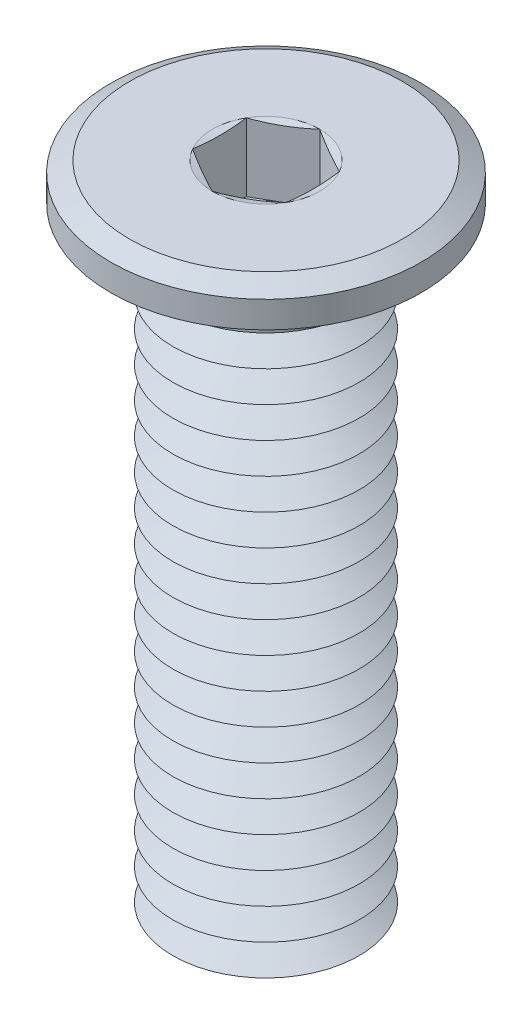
ISO-10303-21;
HEADER;
FILE_DESCRIPTION(('STEP AP214'),'2;1');
FILE_NAME('part.step','',(''),(''),'','','');
FILE_SCHEMA(('AUTOMOTIVE_DESIGN { 1 0 10303 214 1 1 1 1 }'));
ENDSEC;
DATA;
#1=APPLICATION_CONTEXT('core data for automotive mechanical design processes');
#2=APPLICATION_PROTOCOL_DEFINITION('international standard','automotive_design',2000,#1);
#3=PRODUCT_CONTEXT('',#1,'mechanical');
#4=PRODUCT('Part','Part','',(#3));
#5=PRODUCT_RELATED_PRODUCT_CATEGORY('part','',(#4));
#6=PRODUCT_DEFINITION_FORMATION('','',#4);
#7=PRODUCT_DEFINITION_CONTEXT('part definition',#1,'design');
#8=PRODUCT_DEFINITION('design','',#6,#7);
#9=PRODUCT_DEFINITION_SHAPE('','',#8);
#10=(LENGTH_UNIT() NAMED_UNIT(*) SI_UNIT(.MILLI.,.METRE.));
#11=(NAMED_UNIT(*) PLANE_ANGLE_UNIT() SI_UNIT($,.RADIAN.));
#12=(NAMED_UNIT(*) SI_UNIT($,.STERADIAN.) SOLID_ANGLE_UNIT());
#13=UNCERTAINTY_MEASURE_WITH_UNIT(LENGTH_MEASURE(1.E-05),#10,'distance_accuracy_value','');
#14=(GEOMETRIC_REPRESENTATION_CONTEXT(3) GLOBAL_UNCERTAINTY_ASSIGNED_CONTEXT((#13)) GLOBAL_UNIT_ASSIGNED_CONTEXT((#10,
#11,#12)) REPRESENTATION_CONTEXT('',''));
#15=CARTESIAN_POINT('',(0.,0.,0.));
#16=DIRECTION('',(0.,0.,1.));
#17=DIRECTION('',(1.,0.,0.));
#18=AXIS2_PLACEMENT_3D('',#15,#16,#17);
#19=CARTESIAN_POINT('',(0.,-19.7,0.));
#20=DIRECTION('',(0.,-1.,0.));
#21=DIRECTION('',(0.,0.,-1.));
#22=AXIS2_PLACEMENT_3D('',#19,#20,#21);
#23=CONICAL_SURFACE('',#22,3.,1.0471975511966);
#24=CARTESIAN_POINT('',(0.,-19.2,0.));
#25=DIRECTION('',(0.,1.,0.));
#26=DIRECTION('',(0.,0.,1.));
#27=AXIS2_PLACEMENT_3D('',#24,#25,#26);
#28=CIRCLE('',#27,2.13397459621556);
#29=CARTESIAN_POINT('',(0.,-19.2,2.13397459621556));
#30=VERTEX_POINT('',#29);
#31=EDGE_CURVE('E505',#30,#30,#28,.T.);
#32=ORIENTED_EDGE('',*,*,#31,.F.);
#33=EDGE_LOOP('',(#32));
#34=FACE_BOUND('',#33,.T.);
#35=CARTESIAN_POINT('',(0.,-19.7,0.));
#36=DIRECTION('',(0.,1.,0.));
#37=DIRECTION('',(0.,0.,1.));
#38=AXIS2_PLACEMENT_3D('',#35,#36,#37);
#39=CIRCLE('',#38,3.);
#40=CARTESIAN_POINT('',(0.,-19.7,3.));
#41=VERTEX_POINT('',#40);
#42=EDGE_CURVE('E509',#41,#41,#39,.T.);
#43=ORIENTED_EDGE('',*,*,#42,.T.);
#44=EDGE_LOOP('',(#43));
#45=FACE_BOUND('',#44,.T.);
#46=ADVANCED_FACE('F39',(#34,#45),#23,.T.);
#47=CARTESIAN_POINT('',(0.,-19.2,0.));
#48=DIRECTION('',(0.,1.,0.));
#49=DIRECTION('',(0.,0.,1.));
#50=AXIS2_PLACEMENT_3D('',#47,#48,#49);
#51=CONICAL_SURFACE('',#50,2.13397459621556,1.0471975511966);
#52=CARTESIAN_POINT('',(0.,-18.7,0.));
#53=DIRECTION('',(0.,1.,0.));
#54=DIRECTION('',(0.,0.,1.));
#55=AXIS2_PLACEMENT_3D('',#52,#53,#54);
#56=CIRCLE('',#55,3.);
#57=CARTESIAN_POINT('',(0.,-18.7,3.));
#58=VERTEX_POINT('',#57);
#59=EDGE_CURVE('E501',#58,#58,#56,.T.);
#60=ORIENTED_EDGE('',*,*,#59,.F.);
#61=EDGE_LOOP('',(#60));
#62=FACE_BOUND('',#61,.T.);
#63=ORIENTED_EDGE('',*,*,#31,.T.);
#64=EDGE_LOOP('',(#63));
#65=FACE_BOUND('',#64,.T.);
#66=ADVANCED_FACE('F233',(#62,#65),#51,.T.);
#67=CARTESIAN_POINT('',(0.,-21.2,0.));
#68=DIRECTION('',(0.,-1.,0.));
#69=DIRECTION('',(0.,0.,-1.));
#70=AXIS2_PLACEMENT_3D('',#67,#68,#69);
#71=PLANE('',#70);
#72=CARTESIAN_POINT('',(0.,-21.2,0.));
#73=DIRECTION('',(0.,1.,0.));
#74=DIRECTION('',(0.,0.,1.));
#75=AXIS2_PLACEMENT_3D('',#72,#73,#74);
#76=CIRCLE('',#75,2.13397459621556);
#77=CARTESIAN_POINT('',(0.,-21.2,2.13397459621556));
#78=VERTEX_POINT('',#77);
#79=EDGE_CURVE('E300',#78,#78,#76,.T.);
#80=ORIENTED_EDGE('',*,*,#79,.F.);
#81=EDGE_LOOP('',(#80));
#82=FACE_BOUND('',#81,.T.);
#83=ADVANCED_FACE('F239',(#82),#71,.T.);
#84=CARTESIAN_POINT('',(0.,-21.2,0.));
#85=DIRECTION('',(0.,1.,0.));
#86=DIRECTION('',(0.,0.,1.));
#87=AXIS2_PLACEMENT_3D('',#84,#85,#86);
#88=CONICAL_SURFACE('',#87,2.13397459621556,1.0471975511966);
#89=CARTESIAN_POINT('',(0.,-20.7,0.));
#90=DIRECTION('',(0.,1.,0.));
#91=DIRECTION('',(0.,0.,1.));
#92=AXIS2_PLACEMENT_3D('',#89,#90,#91);
#93=CIRCLE('',#92,3.);
#94=CARTESIAN_POINT('',(0.,-20.7,3.));
#95=VERTEX_POINT('',#94);
#96=EDGE_CURVE('E517',#95,#95,#93,.T.);
#97=ORIENTED_EDGE('',*,*,#96,.F.);
#98=EDGE_LOOP('',(#97));
#99=FACE_BOUND('',#98,.T.);
#100=ORIENTED_EDGE('',*,*,#79,.T.);
#101=EDGE_LOOP('',(#100));
#102=FACE_BOUND('',#101,.T.);
#103=ADVANCED_FACE('F254',(#99,#102),#88,.T.);
#104=CARTESIAN_POINT('',(0.,-20.7,0.));
#105=DIRECTION('',(0.,-1.,0.));
#106=DIRECTION('',(0.,0.,-1.));
#107=AXIS2_PLACEMENT_3D('',#104,#105,#106);
#108=CONICAL_SURFACE('',#107,3.,1.0471975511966);
#109=CARTESIAN_POINT('',(0.,-20.2,0.));
#110=DIRECTION('',(0.,1.,0.));
#111=DIRECTION('',(0.,0.,1.));
#112=AXIS2_PLACEMENT_3D('',#109,#110,#111);
#113=CIRCLE('',#112,2.13397459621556);
#114=CARTESIAN_POINT('',(0.,-20.2,2.13397459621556));
#115=VERTEX_POINT('',#114);
#116=EDGE_CURVE('E513',#115,#115,#113,.T.);
#117=ORIENTED_EDGE('',*,*,#116,.F.);
#118=EDGE_LOOP('',(#117));
#119=FACE_BOUND('',#118,.T.);
#120=ORIENTED_EDGE('',*,*,#96,.T.);
#121=EDGE_LOOP('',(#120));
#122=FACE_BOUND('',#121,.T.);
#123=ADVANCED_FACE('F250',(#119,#122),#108,.T.);
#124=CARTESIAN_POINT('',(0.,-20.2,0.));
#125=DIRECTION('',(0.,1.,0.));
#126=DIRECTION('',(0.,0.,1.));
#127=AXIS2_PLACEMENT_3D('',#124,#125,#126);
#128=CONICAL_SURFACE('',#127,2.13397459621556,1.0471975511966);
#129=ORIENTED_EDGE('',*,*,#42,.F.);
#130=EDGE_LOOP('',(#129));
#131=FACE_BOUND('',#130,.T.);
#132=ORIENTED_EDGE('',*,*,#116,.T.);
#133=EDGE_LOOP('',(#132));
#134=FACE_BOUND('',#133,.T.);
#135=ADVANCED_FACE('F246',(#131,#134),#128,.T.);
#136=CARTESIAN_POINT('',(0.,-18.7,0.));
#137=DIRECTION('',(0.,-1.,0.));
#138=DIRECTION('',(0.,0.,-1.));
#139=AXIS2_PLACEMENT_3D('',#136,#137,#138);
#140=CONICAL_SURFACE('',#139,3.,1.0471975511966);
#141=CARTESIAN_POINT('',(0.,-18.2,0.));
#142=DIRECTION('',(0.,1.,0.));
#143=DIRECTION('',(0.,0.,1.));
#144=AXIS2_PLACEMENT_3D('',#141,#142,#143);
#145=CIRCLE('',#144,2.13397459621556);
#146=CARTESIAN_POINT('',(0.,-18.2,2.13397459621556));
#147=VERTEX_POINT('',#146);
#148=EDGE_CURVE('E497',#147,#147,#145,.T.);
#149=ORIENTED_EDGE('',*,*,#148,.F.);
#150=EDGE_LOOP('',(#149));
#151=FACE_BOUND('',#150,.T.);
#152=ORIENTED_EDGE('',*,*,#59,.T.);
#153=EDGE_LOOP('',(#152));
#154=FACE_BOUND('',#153,.T.);
#155=ADVANCED_FACE('F249',(#151,#154),#140,.T.);
#156=CARTESIAN_POINT('',(0.,-18.2,0.));
#157=DIRECTION('',(0.,1.,0.));
#158=DIRECTION('',(0.,0.,1.));
#159=AXIS2_PLACEMENT_3D('',#156,#157,#158);
#160=CONICAL_SURFACE('',#159,2.13397459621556,1.0471975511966);
#161=CARTESIAN_POINT('',(0.,-17.7,0.));
#162=DIRECTION('',(0.,1.,0.));
#163=DIRECTION('',(0.,0.,1.));
#164=AXIS2_PLACEMENT_3D('',#161,#162,#163);
#165=CIRCLE('',#164,3.);
#166=CARTESIAN_POINT('',(0.,-17.7,3.));
#167=VERTEX_POINT('',#166);
#168=EDGE_CURVE('E493',#167,#167,#165,.T.);
#169=ORIENTED_EDGE('',*,*,#168,.F.);
#170=EDGE_LOOP('',(#169));
#171=FACE_BOUND('',#170,.T.);
#172=ORIENTED_EDGE('',*,*,#148,.T.);
#173=EDGE_LOOP('',(#172));
#174=FACE_BOUND('',#173,.T.);
#175=ADVANCED_FACE('F698',(#171,#174),#160,.T.);
#176=CARTESIAN_POINT('',(0.,-17.7,0.));
#177=DIRECTION('',(0.,-1.,0.));
#178=DIRECTION('',(0.,0.,-1.));
#179=AXIS2_PLACEMENT_3D('',#176,#177,#178);
#180=CONICAL_SURFACE('',#179,3.,1.0471975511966);
#181=CARTESIAN_POINT('',(0.,-17.2,0.));
#182=DIRECTION('',(0.,1.,0.));
#183=DIRECTION('',(0.,0.,1.));
#184=AXIS2_PLACEMENT_3D('',#181,#182,#183);
#185=CIRCLE('',#184,2.13397459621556);
#186=CARTESIAN_POINT('',(0.,-17.2,2.13397459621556));
#187=VERTEX_POINT('',#186);
#188=EDGE_CURVE('E489',#187,#187,#185,.T.);
#189=ORIENTED_EDGE('',*,*,#188,.F.);
#190=EDGE_LOOP('',(#189));
#191=FACE_BOUND('',#190,.T.);
#192=ORIENTED_EDGE('',*,*,#168,.T.);
#193=EDGE_LOOP('',(#192));
#194=FACE_BOUND('',#193,.T.);
#195=ADVANCED_FACE('F694',(#191,#194),#180,.T.);
#196=CARTESIAN_POINT('',(0.,-17.2,0.));
#197=DIRECTION('',(0.,1.,0.));
#198=DIRECTION('',(0.,0.,1.));
#199=AXIS2_PLACEMENT_3D('',#196,#197,#198);
#200=CONICAL_SURFACE('',#199,2.13397459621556,1.0471975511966);
#201=CARTESIAN_POINT('',(0.,-16.7,0.));
#202=DIRECTION('',(0.,1.,0.));
#203=DIRECTION('',(0.,0.,1.));
#204=AXIS2_PLACEMENT_3D('',#201,#202,#203);
#205=CIRCLE('',#204,3.);
#206=CARTESIAN_POINT('',(0.,-16.7,3.));
#207=VERTEX_POINT('',#206);
#208=EDGE_CURVE('E485',#207,#207,#205,.T.);
#209=ORIENTED_EDGE('',*,*,#208,.F.);
#210=EDGE_LOOP('',(#209));
#211=FACE_BOUND('',#210,.T.);
#212=ORIENTED_EDGE('',*,*,#188,.T.);
#213=EDGE_LOOP('',(#212));
#214=FACE_BOUND('',#213,.T.);
#215=ADVANCED_FACE('F690',(#211,#214),#200,.T.);
#216=CARTESIAN_POINT('',(0.,-16.7,0.));
#217=DIRECTION('',(0.,-1.,0.));
#218=DIRECTION('',(0.,0.,-1.));
#219=AXIS2_PLACEMENT_3D('',#216,#217,#218);
#220=CONICAL_SURFACE('',#219,3.,1.0471975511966);
#221=CARTESIAN_POINT('',(0.,-16.2,0.));
#222=DIRECTION('',(0.,1.,0.));
#223=DIRECTION('',(0.,0.,1.));
#224=AXIS2_PLACEMENT_3D('',#221,#222,#223);
#225=CIRCLE('',#224,2.13397459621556);
#226=CARTESIAN_POINT('',(0.,-16.2,2.13397459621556));
#227=VERTEX_POINT('',#226);
#228=EDGE_CURVE('E481',#227,#227,#225,.T.);
#229=ORIENTED_EDGE('',*,*,#228,.F.);
#230=EDGE_LOOP('',(#229));
#231=FACE_BOUND('',#230,.T.);
#232=ORIENTED_EDGE('',*,*,#208,.T.);
#233=EDGE_LOOP('',(#232));
#234=FACE_BOUND('',#233,.T.);
#235=ADVANCED_FACE('F686',(#231,#234),#220,.T.);
#236=CARTESIAN_POINT('',(0.,-16.2,0.));
#237=DIRECTION('',(0.,1.,0.));
#238=DIRECTION('',(0.,0.,1.));
#239=AXIS2_PLACEMENT_3D('',#236,#237,#238);
#240=CONICAL_SURFACE('',#239,2.13397459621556,1.0471975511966);
#241=CARTESIAN_POINT('',(0.,-15.7,0.));
#242=DIRECTION('',(0.,1.,0.));
#243=DIRECTION('',(0.,0.,1.));
#244=AXIS2_PLACEMENT_3D('',#241,#242,#243);
#245=CIRCLE('',#244,3.);
#246=CARTESIAN_POINT('',(0.,-15.7,3.));
#247=VERTEX_POINT('',#246);
#248=EDGE_CURVE('E477',#247,#247,#245,.T.);
#249=ORIENTED_EDGE('',*,*,#248,.F.);
#250=EDGE_LOOP('',(#249));
#251=FACE_BOUND('',#250,.T.);
#252=ORIENTED_EDGE('',*,*,#228,.T.);
#253=EDGE_LOOP('',(#252));
#254=FACE_BOUND('',#253,.T.);
#255=ADVANCED_FACE('F682',(#251,#254),#240,.T.);
#256=CARTESIAN_POINT('',(0.,-15.7,0.));
#257=DIRECTION('',(0.,-1.,0.));
#258=DIRECTION('',(0.,0.,-1.));
#259=AXIS2_PLACEMENT_3D('',#256,#257,#258);
#260=CONICAL_SURFACE('',#259,3.,1.0471975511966);
#261=CARTESIAN_POINT('',(0.,-15.2,0.));
#262=DIRECTION('',(0.,1.,0.));
#263=DIRECTION('',(0.,0.,1.));
#264=AXIS2_PLACEMENT_3D('',#261,#262,#263);
#265=CIRCLE('',#264,2.13397459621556);
#266=CARTESIAN_POINT('',(0.,-15.2,2.13397459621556));
#267=VERTEX_POINT('',#266);
#268=EDGE_CURVE('E473',#267,#267,#265,.T.);
#269=ORIENTED_EDGE('',*,*,#268,.F.);
#270=EDGE_LOOP('',(#269));
#271=FACE_BOUND('',#270,.T.);
#272=ORIENTED_EDGE('',*,*,#248,.T.);
#273=EDGE_LOOP('',(#272));
#274=FACE_BOUND('',#273,.T.);
#275=ADVANCED_FACE('F678',(#271,#274),#260,.T.);
#276=CARTESIAN_POINT('',(0.,-15.2,0.));
#277=DIRECTION('',(0.,1.,0.));
#278=DIRECTION('',(0.,0.,1.));
#279=AXIS2_PLACEMENT_3D('',#276,#277,#278);
#280=CONICAL_SURFACE('',#279,2.13397459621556,1.0471975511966);
#281=CARTESIAN_POINT('',(0.,-14.7,0.));
#282=DIRECTION('',(0.,1.,0.));
#283=DIRECTION('',(0.,0.,1.));
#284=AXIS2_PLACEMENT_3D('',#281,#282,#283);
#285=CIRCLE('',#284,3.);
#286=CARTESIAN_POINT('',(0.,-14.7,3.));
#287=VERTEX_POINT('',#286);
#288=EDGE_CURVE('E469',#287,#287,#285,.T.);
#289=ORIENTED_EDGE('',*,*,#288,.F.);
#290=EDGE_LOOP('',(#289));
#291=FACE_BOUND('',#290,.T.);
#292=ORIENTED_EDGE('',*,*,#268,.T.);
#293=EDGE_LOOP('',(#292));
#294=FACE_BOUND('',#293,.T.);
#295=ADVANCED_FACE('F674',(#291,#294),#280,.T.);
#296=CARTESIAN_POINT('',(0.,-14.7,0.));
#297=DIRECTION('',(0.,-1.,0.));
#298=DIRECTION('',(0.,0.,-1.));
#299=AXIS2_PLACEMENT_3D('',#296,#297,#298);
#300=CONICAL_SURFACE('',#299,3.,1.0471975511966);
#301=CARTESIAN_POINT('',(0.,-14.2,0.));
#302=DIRECTION('',(0.,1.,0.));
#303=DIRECTION('',(0.,0.,1.));
#304=AXIS2_PLACEMENT_3D('',#301,#302,#303);
#305=CIRCLE('',#304,2.13397459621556);
#306=CARTESIAN_POINT('',(0.,-14.2,2.13397459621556));
#307=VERTEX_POINT('',#306);
#308=EDGE_CURVE('E466',#307,#307,#305,.T.);
#309=ORIENTED_EDGE('',*,*,#308,.F.);
#310=EDGE_LOOP('',(#309));
#311=FACE_BOUND('',#310,.T.);
#312=ORIENTED_EDGE('',*,*,#288,.T.);
#313=EDGE_LOOP('',(#312));
#314=FACE_BOUND('',#313,.T.);
#315=ADVANCED_FACE('F670',(#311,#314),#300,.T.);
#316=CARTESIAN_POINT('',(0.,-14.2,0.));
#317=DIRECTION('',(0.,1.,0.));
#318=DIRECTION('',(0.,0.,1.));
#319=AXIS2_PLACEMENT_3D('',#316,#317,#318);
#320=CONICAL_SURFACE('',#319,2.13397459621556,1.0471975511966);
#321=CARTESIAN_POINT('',(0.,-13.7,0.));
#322=DIRECTION('',(0.,1.,0.));
#323=DIRECTION('',(0.,0.,1.));
#324=AXIS2_PLACEMENT_3D('',#321,#322,#323);
#325=CIRCLE('',#324,3.);
#326=CARTESIAN_POINT('',(0.,-13.7,3.));
#327=VERTEX_POINT('',#326);
#328=EDGE_CURVE('E462',#327,#327,#325,.T.);
#329=ORIENTED_EDGE('',*,*,#328,.F.);
#330=EDGE_LOOP('',(#329));
#331=FACE_BOUND('',#330,.T.);
#332=ORIENTED_EDGE('',*,*,#308,.T.);
#333=EDGE_LOOP('',(#332));
#334=FACE_BOUND('',#333,.T.);
#335=ADVANCED_FACE('F666',(#331,#334),#320,.T.);
#336=CARTESIAN_POINT('',(0.,-13.7,0.));
#337=DIRECTION('',(0.,-1.,0.));
#338=DIRECTION('',(0.,0.,-1.));
#339=AXIS2_PLACEMENT_3D('',#336,#337,#338);
#340=CONICAL_SURFACE('',#339,3.,1.0471975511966);
#341=CARTESIAN_POINT('',(0.,-13.2,0.));
#342=DIRECTION('',(0.,1.,0.));
#343=DIRECTION('',(0.,0.,1.));
#344=AXIS2_PLACEMENT_3D('',#341,#342,#343);
#345=CIRCLE('',#344,2.13397459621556);
#346=CARTESIAN_POINT('',(0.,-13.2,2.13397459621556));
#347=VERTEX_POINT('',#346);
#348=EDGE_CURVE('E458',#347,#347,#345,.T.);
#349=ORIENTED_EDGE('',*,*,#348,.F.);
#350=EDGE_LOOP('',(#349));
#351=FACE_BOUND('',#350,.T.);
#352=ORIENTED_EDGE('',*,*,#328,.T.);
#353=EDGE_LOOP('',(#352));
#354=FACE_BOUND('',#353,.T.);
#355=ADVANCED_FACE('F662',(#351,#354),#340,.T.);
#356=CARTESIAN_POINT('',(0.,-13.2,0.));
#357=DIRECTION('',(0.,1.,0.));
#358=DIRECTION('',(0.,0.,1.));
#359=AXIS2_PLACEMENT_3D('',#356,#357,#358);
#360=CONICAL_SURFACE('',#359,2.13397459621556,1.0471975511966);
#361=CARTESIAN_POINT('',(0.,-12.7,0.));
#362=DIRECTION('',(0.,1.,0.));
#363=DIRECTION('',(0.,0.,1.));
#364=AXIS2_PLACEMENT_3D('',#361,#362,#363);
#365=CIRCLE('',#364,3.);
#366=CARTESIAN_POINT('',(0.,-12.7,3.));
#367=VERTEX_POINT('',#366);
#368=EDGE_CURVE('E454',#367,#367,#365,.T.);
#369=ORIENTED_EDGE('',*,*,#368,.F.);
#370=EDGE_LOOP('',(#369));
#371=FACE_BOUND('',#370,.T.);
#372=ORIENTED_EDGE('',*,*,#348,.T.);
#373=EDGE_LOOP('',(#372));
#374=FACE_BOUND('',#373,.T.);
#375=ADVANCED_FACE('F658',(#371,#374),#360,.T.);
#376=CARTESIAN_POINT('',(0.,-12.7,0.));
#377=DIRECTION('',(0.,-1.,0.));
#378=DIRECTION('',(0.,0.,-1.));
#379=AXIS2_PLACEMENT_3D('',#376,#377,#378);
#380=CONICAL_SURFACE('',#379,3.,1.0471975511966);
#381=CARTESIAN_POINT('',(0.,-12.2,0.));
#382=DIRECTION('',(0.,1.,0.));
#383=DIRECTION('',(0.,0.,1.));
#384=AXIS2_PLACEMENT_3D('',#381,#382,#383);
#385=CIRCLE('',#384,2.13397459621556);
#386=CARTESIAN_POINT('',(0.,-12.2,2.13397459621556));
#387=VERTEX_POINT('',#386);
#388=EDGE_CURVE('E450',#387,#387,#385,.T.);
#389=ORIENTED_EDGE('',*,*,#388,.F.);
#390=EDGE_LOOP('',(#389));
#391=FACE_BOUND('',#390,.T.);
#392=ORIENTED_EDGE('',*,*,#368,.T.);
#393=EDGE_LOOP('',(#392));
#394=FACE_BOUND('',#393,.T.);
#395=ADVANCED_FACE('F654',(#391,#394),#380,.T.);
#396=CARTESIAN_POINT('',(0.,-12.2,0.));
#397=DIRECTION('',(0.,1.,0.));
#398=DIRECTION('',(0.,0.,1.));
#399=AXIS2_PLACEMENT_3D('',#396,#397,#398);
#400=CONICAL_SURFACE('',#399,2.13397459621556,1.0471975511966);
#401=CARTESIAN_POINT('',(0.,-11.7,0.));
#402=DIRECTION('',(0.,1.,0.));
#403=DIRECTION('',(0.,0.,1.));
#404=AXIS2_PLACEMENT_3D('',#401,#402,#403);
#405=CIRCLE('',#404,3.);
#406=CARTESIAN_POINT('',(0.,-11.7,3.));
#407=VERTEX_POINT('',#406);
#408=EDGE_CURVE('E446',#407,#407,#405,.T.);
#409=ORIENTED_EDGE('',*,*,#408,.F.);
#410=EDGE_LOOP('',(#409));
#411=FACE_BOUND('',#410,.T.);
#412=ORIENTED_EDGE('',*,*,#388,.T.);
#413=EDGE_LOOP('',(#412));
#414=FACE_BOUND('',#413,.T.);
#415=ADVANCED_FACE('F650',(#411,#414),#400,.T.);
#416=CARTESIAN_POINT('',(0.,-11.7,0.));
#417=DIRECTION('',(0.,-1.,0.));
#418=DIRECTION('',(0.,0.,-1.));
#419=AXIS2_PLACEMENT_3D('',#416,#417,#418);
#420=CONICAL_SURFACE('',#419,3.,1.0471975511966);
#421=CARTESIAN_POINT('',(0.,-11.2,0.));
#422=DIRECTION('',(0.,1.,0.));
#423=DIRECTION('',(0.,0.,1.));
#424=AXIS2_PLACEMENT_3D('',#421,#422,#423);
#425=CIRCLE('',#424,2.13397459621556);
#426=CARTESIAN_POINT('',(0.,-11.2,2.13397459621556));
#427=VERTEX_POINT('',#426);
#428=EDGE_CURVE('E442',#427,#427,#425,.T.);
#429=ORIENTED_EDGE('',*,*,#428,.F.);
#430=EDGE_LOOP('',(#429));
#431=FACE_BOUND('',#430,.T.);
#432=ORIENTED_EDGE('',*,*,#408,.T.);
#433=EDGE_LOOP('',(#432));
#434=FACE_BOUND('',#433,.T.);
#435=ADVANCED_FACE('F646',(#431,#434),#420,.T.);
#436=CARTESIAN_POINT('',(0.,-11.2,0.));
#437=DIRECTION('',(0.,1.,0.));
#438=DIRECTION('',(0.,0.,1.));
#439=AXIS2_PLACEMENT_3D('',#436,#437,#438);
#440=CONICAL_SURFACE('',#439,2.13397459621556,1.0471975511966);
#441=CARTESIAN_POINT('',(0.,-10.7,0.));
#442=DIRECTION('',(0.,1.,0.));
#443=DIRECTION('',(0.,0.,1.));
#444=AXIS2_PLACEMENT_3D('',#441,#442,#443);
#445=CIRCLE('',#444,3.);
#446=CARTESIAN_POINT('',(0.,-10.7,3.));
#447=VERTEX_POINT('',#446);
#448=EDGE_CURVE('E438',#447,#447,#445,.T.);
#449=ORIENTED_EDGE('',*,*,#448,.F.);
#450=EDGE_LOOP('',(#449));
#451=FACE_BOUND('',#450,.T.);
#452=ORIENTED_EDGE('',*,*,#428,.T.);
#453=EDGE_LOOP('',(#452));
#454=FACE_BOUND('',#453,.T.);
#455=ADVANCED_FACE('F642',(#451,#454),#440,.T.);
#456=CARTESIAN_POINT('',(0.,-10.7,0.));
#457=DIRECTION('',(0.,-1.,0.));
#458=DIRECTION('',(0.,0.,-1.));
#459=AXIS2_PLACEMENT_3D('',#456,#457,#458);
#460=CONICAL_SURFACE('',#459,3.,1.0471975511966);
#461=CARTESIAN_POINT('',(0.,-10.2,0.));
#462=DIRECTION('',(0.,1.,0.));
#463=DIRECTION('',(0.,0.,1.));
#464=AXIS2_PLACEMENT_3D('',#461,#462,#463);
#465=CIRCLE('',#464,2.13397459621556);
#466=CARTESIAN_POINT('',(0.,-10.2,2.13397459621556));
#467=VERTEX_POINT('',#466);
#468=EDGE_CURVE('E434',#467,#467,#465,.T.);
#469=ORIENTED_EDGE('',*,*,#468,.F.);
#470=EDGE_LOOP('',(#469));
#471=FACE_BOUND('',#470,.T.);
#472=ORIENTED_EDGE('',*,*,#448,.T.);
#473=EDGE_LOOP('',(#472));
#474=FACE_BOUND('',#473,.T.);
#475=ADVANCED_FACE('F638',(#471,#474),#460,.T.);
#476=CARTESIAN_POINT('',(0.,-10.2,0.));
#477=DIRECTION('',(0.,1.,0.));
#478=DIRECTION('',(0.,0.,1.));
#479=AXIS2_PLACEMENT_3D('',#476,#477,#478);
#480=CONICAL_SURFACE('',#479,2.13397459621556,1.0471975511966);
#481=CARTESIAN_POINT('',(0.,-9.7,0.));
#482=DIRECTION('',(0.,1.,0.));
#483=DIRECTION('',(0.,0.,1.));
#484=AXIS2_PLACEMENT_3D('',#481,#482,#483);
#485=CIRCLE('',#484,3.);
#486=CARTESIAN_POINT('',(0.,-9.7,3.));
#487=VERTEX_POINT('',#486);
#488=EDGE_CURVE('E430',#487,#487,#485,.T.);
#489=ORIENTED_EDGE('',*,*,#488,.F.);
#490=EDGE_LOOP('',(#489));
#491=FACE_BOUND('',#490,.T.);
#492=ORIENTED_EDGE('',*,*,#468,.T.);
#493=EDGE_LOOP('',(#492));
#494=FACE_BOUND('',#493,.T.);
#495=ADVANCED_FACE('F634',(#491,#494),#480,.T.);
#496=CARTESIAN_POINT('',(0.,-9.7,0.));
#497=DIRECTION('',(0.,-1.,0.));
#498=DIRECTION('',(0.,0.,-1.));
#499=AXIS2_PLACEMENT_3D('',#496,#497,#498);
#500=CONICAL_SURFACE('',#499,3.,1.0471975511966);
#501=CARTESIAN_POINT('',(0.,-9.2,0.));
#502=DIRECTION('',(0.,1.,0.));
#503=DIRECTION('',(0.,0.,1.));
#504=AXIS2_PLACEMENT_3D('',#501,#502,#503);
#505=CIRCLE('',#504,2.13397459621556);
#506=CARTESIAN_POINT('',(0.,-9.2,2.13397459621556));
#507=VERTEX_POINT('',#506);
#508=EDGE_CURVE('E426',#507,#507,#505,.T.);
#509=ORIENTED_EDGE('',*,*,#508,.F.);
#510=EDGE_LOOP('',(#509));
#511=FACE_BOUND('',#510,.T.);
#512=ORIENTED_EDGE('',*,*,#488,.T.);
#513=EDGE_LOOP('',(#512));
#514=FACE_BOUND('',#513,.T.);
#515=ADVANCED_FACE('F630',(#511,#514),#500,.T.);
#516=CARTESIAN_POINT('',(0.,-9.2,0.));
#517=DIRECTION('',(0.,1.,0.));
#518=DIRECTION('',(0.,0.,1.));
#519=AXIS2_PLACEMENT_3D('',#516,#517,#518);
#520=CONICAL_SURFACE('',#519,2.13397459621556,1.0471975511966);
#521=CARTESIAN_POINT('',(0.,-8.7,0.));
#522=DIRECTION('',(0.,1.,0.));
#523=DIRECTION('',(0.,0.,1.));
#524=AXIS2_PLACEMENT_3D('',#521,#522,#523);
#525=CIRCLE('',#524,3.);
#526=CARTESIAN_POINT('',(0.,-8.7,3.));
#527=VERTEX_POINT('',#526);
#528=EDGE_CURVE('E422',#527,#527,#525,.T.);
#529=ORIENTED_EDGE('',*,*,#528,.F.);
#530=EDGE_LOOP('',(#529));
#531=FACE_BOUND('',#530,.T.);
#532=ORIENTED_EDGE('',*,*,#508,.T.);
#533=EDGE_LOOP('',(#532));
#534=FACE_BOUND('',#533,.T.);
#535=ADVANCED_FACE('F626',(#531,#534),#520,.T.);
#536=CARTESIAN_POINT('',(0.,-8.7,0.));
#537=DIRECTION('',(0.,-1.,0.));
#538=DIRECTION('',(0.,0.,-1.));
#539=AXIS2_PLACEMENT_3D('',#536,#537,#538);
#540=CONICAL_SURFACE('',#539,3.,1.0471975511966);
#541=CARTESIAN_POINT('',(0.,-8.2,0.));
#542=DIRECTION('',(0.,1.,0.));
#543=DIRECTION('',(0.,0.,1.));
#544=AXIS2_PLACEMENT_3D('',#541,#542,#543);
#545=CIRCLE('',#544,2.13397459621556);
#546=CARTESIAN_POINT('',(0.,-8.2,2.13397459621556));
#547=VERTEX_POINT('',#546);
#548=EDGE_CURVE('E418',#547,#547,#545,.T.);
#549=ORIENTED_EDGE('',*,*,#548,.F.);
#550=EDGE_LOOP('',(#549));
#551=FACE_BOUND('',#550,.T.);
#552=ORIENTED_EDGE('',*,*,#528,.T.);
#553=EDGE_LOOP('',(#552));
#554=FACE_BOUND('',#553,.T.);
#555=ADVANCED_FACE('F622',(#551,#554),#540,.T.);
#556=CARTESIAN_POINT('',(0.,-8.2,0.));
#557=DIRECTION('',(0.,1.,0.));
#558=DIRECTION('',(0.,0.,1.));
#559=AXIS2_PLACEMENT_3D('',#556,#557,#558);
#560=CONICAL_SURFACE('',#559,2.13397459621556,1.0471975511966);
#561=CARTESIAN_POINT('',(0.,-7.7,0.));
#562=DIRECTION('',(0.,1.,0.));
#563=DIRECTION('',(0.,0.,1.));
#564=AXIS2_PLACEMENT_3D('',#561,#562,#563);
#565=CIRCLE('',#564,3.);
#566=CARTESIAN_POINT('',(0.,-7.7,3.));
#567=VERTEX_POINT('',#566);
#568=EDGE_CURVE('E414',#567,#567,#565,.T.);
#569=ORIENTED_EDGE('',*,*,#568,.F.);
#570=EDGE_LOOP('',(#569));
#571=FACE_BOUND('',#570,.T.);
#572=ORIENTED_EDGE('',*,*,#548,.T.);
#573=EDGE_LOOP('',(#572));
#574=FACE_BOUND('',#573,.T.);
#575=ADVANCED_FACE('F618',(#571,#574),#560,.T.);
#576=CARTESIAN_POINT('',(0.,-7.7,0.));
#577=DIRECTION('',(0.,-1.,0.));
#578=DIRECTION('',(0.,0.,-1.));
#579=AXIS2_PLACEMENT_3D('',#576,#577,#578);
#580=CONICAL_SURFACE('',#579,3.,1.0471975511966);
#581=CARTESIAN_POINT('',(0.,-7.2,0.));
#582=DIRECTION('',(0.,1.,0.));
#583=DIRECTION('',(0.,0.,1.));
#584=AXIS2_PLACEMENT_3D('',#581,#582,#583);
#585=CIRCLE('',#584,2.13397459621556);
#586=CARTESIAN_POINT('',(0.,-7.2,2.13397459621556));
#587=VERTEX_POINT('',#586);
#588=EDGE_CURVE('E410',#587,#587,#585,.T.);
#589=ORIENTED_EDGE('',*,*,#588,.F.);
#590=EDGE_LOOP('',(#589));
#591=FACE_BOUND('',#590,.T.);
#592=ORIENTED_EDGE('',*,*,#568,.T.);
#593=EDGE_LOOP('',(#592));
#594=FACE_BOUND('',#593,.T.);
#595=ADVANCED_FACE('F614',(#591,#594),#580,.T.);
#596=CARTESIAN_POINT('',(0.,-7.2,0.));
#597=DIRECTION('',(0.,1.,0.));
#598=DIRECTION('',(0.,0.,1.));
#599=AXIS2_PLACEMENT_3D('',#596,#597,#598);
#600=CONICAL_SURFACE('',#599,2.13397459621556,1.0471975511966);
#601=CARTESIAN_POINT('',(0.,-6.7,0.));
#602=DIRECTION('',(0.,1.,0.));
#603=DIRECTION('',(0.,0.,1.));
#604=AXIS2_PLACEMENT_3D('',#601,#602,#603);
#605=CIRCLE('',#604,3.);
#606=CARTESIAN_POINT('',(0.,-6.7,3.));
#607=VERTEX_POINT('',#606);
#608=EDGE_CURVE('E407',#607,#607,#605,.T.);
#609=ORIENTED_EDGE('',*,*,#608,.F.);
#610=EDGE_LOOP('',(#609));
#611=FACE_BOUND('',#610,.T.);
#612=ORIENTED_EDGE('',*,*,#588,.T.);
#613=EDGE_LOOP('',(#612));
#614=FACE_BOUND('',#613,.T.);
#615=ADVANCED_FACE('F610',(#611,#614),#600,.T.);
#616=CARTESIAN_POINT('',(0.,-6.7,0.));
#617=DIRECTION('',(0.,-1.,0.));
#618=DIRECTION('',(0.,0.,-1.));
#619=AXIS2_PLACEMENT_3D('',#616,#617,#618);
#620=CONICAL_SURFACE('',#619,3.,1.0471975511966);
#621=CARTESIAN_POINT('',(0.,-6.2,0.));
#622=DIRECTION('',(0.,1.,0.));
#623=DIRECTION('',(0.,0.,1.));
#624=AXIS2_PLACEMENT_3D('',#621,#622,#623);
#625=CIRCLE('',#624,2.13397459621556);
#626=CARTESIAN_POINT('',(0.,-6.2,2.13397459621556));
#627=VERTEX_POINT('',#626);
#628=EDGE_CURVE('E403',#627,#627,#625,.T.);
#629=ORIENTED_EDGE('',*,*,#628,.F.);
#630=EDGE_LOOP('',(#629));
#631=FACE_BOUND('',#630,.T.);
#632=ORIENTED_EDGE('',*,*,#608,.T.);
#633=EDGE_LOOP('',(#632));
#634=FACE_BOUND('',#633,.T.);
#635=ADVANCED_FACE('F606',(#631,#634),#620,.T.);
#636=CARTESIAN_POINT('',(0.,-6.2,0.));
#637=DIRECTION('',(0.,1.,0.));
#638=DIRECTION('',(0.,0.,1.));
#639=AXIS2_PLACEMENT_3D('',#636,#637,#638);
#640=CONICAL_SURFACE('',#639,2.13397459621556,1.0471975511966);
#641=CARTESIAN_POINT('',(0.,-5.7,0.));
#642=DIRECTION('',(0.,1.,0.));
#643=DIRECTION('',(0.,0.,1.));
#644=AXIS2_PLACEMENT_3D('',#641,#642,#643);
#645=CIRCLE('',#644,3.);
#646=CARTESIAN_POINT('',(0.,-5.7,3.));
#647=VERTEX_POINT('',#646);
#648=EDGE_CURVE('E399',#647,#647,#645,.T.);
#649=ORIENTED_EDGE('',*,*,#648,.F.);
#650=EDGE_LOOP('',(#649));
#651=FACE_BOUND('',#650,.T.);
#652=ORIENTED_EDGE('',*,*,#628,.T.);
#653=EDGE_LOOP('',(#652));
#654=FACE_BOUND('',#653,.T.);
#655=ADVANCED_FACE('F602',(#651,#654),#640,.T.);
#656=CARTESIAN_POINT('',(0.,-5.7,0.));
#657=DIRECTION('',(0.,-1.,0.));
#658=DIRECTION('',(0.,0.,-1.));
#659=AXIS2_PLACEMENT_3D('',#656,#657,#658);
#660=CONICAL_SURFACE('',#659,3.,1.0471975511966);
#661=CARTESIAN_POINT('',(0.,-5.2,0.));
#662=DIRECTION('',(0.,1.,0.));
#663=DIRECTION('',(0.,0.,1.));
#664=AXIS2_PLACEMENT_3D('',#661,#662,#663);
#665=CIRCLE('',#664,2.13397459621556);
#666=CARTESIAN_POINT('',(0.,-5.2,2.13397459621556));
#667=VERTEX_POINT('',#666);
#668=EDGE_CURVE('E395',#667,#667,#665,.T.);
#669=ORIENTED_EDGE('',*,*,#668,.F.);
#670=EDGE_LOOP('',(#669));
#671=FACE_BOUND('',#670,.T.);
#672=ORIENTED_EDGE('',*,*,#648,.T.);
#673=EDGE_LOOP('',(#672));
#674=FACE_BOUND('',#673,.T.);
#675=ADVANCED_FACE('F598',(#671,#674),#660,.T.);
#676=CARTESIAN_POINT('',(0.,-5.2,0.));
#677=DIRECTION('',(0.,1.,0.));
#678=DIRECTION('',(0.,0.,1.));
#679=AXIS2_PLACEMENT_3D('',#676,#677,#678);
#680=CONICAL_SURFACE('',#679,2.13397459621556,1.0471975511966);
#681=CARTESIAN_POINT('',(0.,-4.7,0.));
#682=DIRECTION('',(0.,1.,0.));
#683=DIRECTION('',(0.,0.,1.));
#684=AXIS2_PLACEMENT_3D('',#681,#682,#683);
#685=CIRCLE('',#684,3.);
#686=CARTESIAN_POINT('',(0.,-4.7,3.));
#687=VERTEX_POINT('',#686);
#688=EDGE_CURVE('E391',#687,#687,#685,.T.);
#689=ORIENTED_EDGE('',*,*,#688,.F.);
#690=EDGE_LOOP('',(#689));
#691=FACE_BOUND('',#690,.T.);
#692=ORIENTED_EDGE('',*,*,#668,.T.);
#693=EDGE_LOOP('',(#692));
#694=FACE_BOUND('',#693,.T.);
#695=ADVANCED_FACE('F594',(#691,#694),#680,.T.);
#696=CARTESIAN_POINT('',(0.,-4.7,0.));
#697=DIRECTION('',(0.,-1.,0.));
#698=DIRECTION('',(0.,0.,-1.));
#699=AXIS2_PLACEMENT_3D('',#696,#697,#698);
#700=CONICAL_SURFACE('',#699,3.,1.0471975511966);
#701=CARTESIAN_POINT('',(0.,-4.2,0.));
#702=DIRECTION('',(0.,1.,0.));
#703=DIRECTION('',(0.,0.,1.));
#704=AXIS2_PLACEMENT_3D('',#701,#702,#703);
#705=CIRCLE('',#704,2.13397459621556);
#706=CARTESIAN_POINT('',(0.,-4.2,2.13397459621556));
#707=VERTEX_POINT('',#706);
#708=EDGE_CURVE('E387',#707,#707,#705,.T.);
#709=ORIENTED_EDGE('',*,*,#708,.F.);
#710=EDGE_LOOP('',(#709));
#711=FACE_BOUND('',#710,.T.);
#712=ORIENTED_EDGE('',*,*,#688,.T.);
#713=EDGE_LOOP('',(#712));
#714=FACE_BOUND('',#713,.T.);
#715=ADVANCED_FACE('F590',(#711,#714),#700,.T.);
#716=CARTESIAN_POINT('',(0.,-4.2,0.));
#717=DIRECTION('',(0.,1.,0.));
#718=DIRECTION('',(0.,0.,1.));
#719=AXIS2_PLACEMENT_3D('',#716,#717,#718);
#720=CONICAL_SURFACE('',#719,2.13397459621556,1.0471975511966);
#721=CARTESIAN_POINT('',(0.,-3.7,0.));
#722=DIRECTION('',(0.,1.,0.));
#723=DIRECTION('',(0.,0.,1.));
#724=AXIS2_PLACEMENT_3D('',#721,#722,#723);
#725=CIRCLE('',#724,3.);
#726=CARTESIAN_POINT('',(0.,-3.7,3.));
#727=VERTEX_POINT('',#726);
#728=EDGE_CURVE('E383',#727,#727,#725,.T.);
#729=ORIENTED_EDGE('',*,*,#728,.F.);
#730=EDGE_LOOP('',(#729));
#731=FACE_BOUND('',#730,.T.);
#732=ORIENTED_EDGE('',*,*,#708,.T.);
#733=EDGE_LOOP('',(#732));
#734=FACE_BOUND('',#733,.T.);
#735=ADVANCED_FACE('F586',(#731,#734),#720,.T.);
#736=CARTESIAN_POINT('',(0.,-3.7,0.));
#737=DIRECTION('',(0.,-1.,0.));
#738=DIRECTION('',(0.,0.,-1.));
#739=AXIS2_PLACEMENT_3D('',#736,#737,#738);
#740=CONICAL_SURFACE('',#739,3.,1.0471975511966);
#741=CARTESIAN_POINT('',(0.,-3.2,0.));
#742=DIRECTION('',(0.,1.,0.));
#743=DIRECTION('',(0.,0.,1.));
#744=AXIS2_PLACEMENT_3D('',#741,#742,#743);
#745=CIRCLE('',#744,2.13397459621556);
#746=CARTESIAN_POINT('',(0.,-3.2,2.13397459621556));
#747=VERTEX_POINT('',#746);
#748=EDGE_CURVE('E379',#747,#747,#745,.T.);
#749=ORIENTED_EDGE('',*,*,#748,.F.);
#750=EDGE_LOOP('',(#749));
#751=FACE_BOUND('',#750,.T.);
#752=ORIENTED_EDGE('',*,*,#728,.T.);
#753=EDGE_LOOP('',(#752));
#754=FACE_BOUND('',#753,.T.);
#755=ADVANCED_FACE('F582',(#751,#754),#740,.T.);
#756=CARTESIAN_POINT('',(0.,-3.2,0.));
#757=DIRECTION('',(0.,1.,0.));
#758=DIRECTION('',(0.,0.,1.));
#759=AXIS2_PLACEMENT_3D('',#756,#757,#758);
#760=CONICAL_SURFACE('',#759,2.13397459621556,1.0471975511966);
#761=CARTESIAN_POINT('',(0.,-2.7,0.));
#762=DIRECTION('',(0.,1.,0.));
#763=DIRECTION('',(0.,0.,1.));
#764=AXIS2_PLACEMENT_3D('',#761,#762,#763);
#765=CIRCLE('',#764,3.);
#766=CARTESIAN_POINT('',(0.,-2.7,3.));
#767=VERTEX_POINT('',#766);
#768=EDGE_CURVE('E363',#767,#767,#765,.T.);
#769=ORIENTED_EDGE('',*,*,#768,.F.);
#770=EDGE_LOOP('',(#769));
#771=FACE_BOUND('',#770,.T.);
#772=ORIENTED_EDGE('',*,*,#748,.T.);
#773=EDGE_LOOP('',(#772));
#774=FACE_BOUND('',#773,.T.);
#775=ADVANCED_FACE('F274',(#771,#774),#760,.T.);
#776=CARTESIAN_POINT('',(0.,0.,0.));
#777=DIRECTION('',(0.,1.,0.));
#778=DIRECTION('',(0.,0.,1.));
#779=AXIS2_PLACEMENT_3D('',#776,#777,#778);
#780=PLANE('',#779);
#781=CARTESIAN_POINT('',(0.,0.,0.));
#782=DIRECTION('',(0.,1.,0.));
#783=DIRECTION('',(0.,0.,1.));
#784=AXIS2_PLACEMENT_3D('',#781,#782,#783);
#785=CIRCLE('',#784,1.73205080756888);
#786=CARTESIAN_POINT('',(0.,0.,1.73205080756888));
#787=VERTEX_POINT('',#786);
#788=CARTESIAN_POINT('',(1.5,0.,0.86602540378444));
#789=VERTEX_POINT('',#788);
#790=EDGE_CURVE('E66',#787,#789,#785,.T.);
#791=ORIENTED_EDGE('',*,*,#790,.F.);
#792=CARTESIAN_POINT('',(-1.5,0.,0.866025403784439));
#793=VERTEX_POINT('',#792);
#794=EDGE_CURVE('E169',#793,#787,#785,.T.);
#795=ORIENTED_EDGE('',*,*,#794,.F.);
#796=CARTESIAN_POINT('',(-1.5,0.,-0.86602540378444));
#797=VERTEX_POINT('',#796);
#798=EDGE_CURVE('E164',#797,#793,#785,.T.);
#799=ORIENTED_EDGE('',*,*,#798,.F.);
#800=CARTESIAN_POINT('',(0.,0.,-1.73205080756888));
#801=VERTEX_POINT('',#800);
#802=EDGE_CURVE('E128',#801,#797,#785,.T.);
#803=ORIENTED_EDGE('',*,*,#802,.F.);
#804=CARTESIAN_POINT('',(1.5,0.,-0.866025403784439));
#805=VERTEX_POINT('',#804);
#806=EDGE_CURVE('E119',#805,#801,#785,.T.);
#807=ORIENTED_EDGE('',*,*,#806,.F.);
#808=EDGE_CURVE('E59',#789,#805,#785,.T.);
#809=ORIENTED_EDGE('',*,*,#808,.F.);
#810=EDGE_LOOP('',(#791,#795,#799,#803,#807,#809));
#811=FACE_BOUND('',#810,.T.);
#812=CARTESIAN_POINT('',(0.,0.,0.));
#813=DIRECTION('',(0.,1.,0.));
#814=DIRECTION('',(0.,0.,1.));
#815=AXIS2_PLACEMENT_3D('',#812,#813,#814);
#816=CIRCLE('',#815,4.4);
#817=CARTESIAN_POINT('',(0.,0.,4.4));
#818=VERTEX_POINT('',#817);
#819=EDGE_CURVE('E296',#818,#818,#816,.T.);
#820=ORIENTED_EDGE('',*,*,#819,.T.);
#821=EDGE_LOOP('',(#820));
#822=FACE_BOUND('',#821,.T.);
#823=ADVANCED_FACE('F160',(#811,#822),#780,.T.);
#824=CARTESIAN_POINT('',(0.,-1.2,0.));
#825=DIRECTION('',(0.,1.,0.));
#826=DIRECTION('',(0.,0.,1.));
#827=AXIS2_PLACEMENT_3D('',#824,#825,#826);
#828=CYLINDRICAL_SURFACE('',#827,5.);
#829=CARTESIAN_POINT('',(0.,-0.346410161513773,0.));
#830=DIRECTION('',(0.,1.,0.));
#831=DIRECTION('',(0.,0.,1.));
#832=AXIS2_PLACEMENT_3D('',#829,#830,#831);
#833=CIRCLE('',#832,5.);
#834=CARTESIAN_POINT('',(0.,-0.346410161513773,5.));
#835=VERTEX_POINT('',#834);
#836=EDGE_CURVE('E307',#835,#835,#833,.F.);
#837=ORIENTED_EDGE('',*,*,#836,.T.);
#838=EDGE_LOOP('',(#837));
#839=FACE_BOUND('',#838,.T.);
#840=CARTESIAN_POINT('',(0.,-1.2,0.));
#841=DIRECTION('',(0.,1.,0.));
#842=DIRECTION('',(0.,0.,1.));
#843=AXIS2_PLACEMENT_3D('',#840,#841,#842);
#844=CIRCLE('',#843,5.);
#845=CARTESIAN_POINT('',(0.,-1.2,5.));
#846=VERTEX_POINT('',#845);
#847=EDGE_CURVE('E291',#846,#846,#844,.T.);
#848=ORIENTED_EDGE('',*,*,#847,.T.);
#849=EDGE_LOOP('',(#848));
#850=FACE_BOUND('',#849,.T.);
#851=ADVANCED_FACE('F270',(#839,#850),#828,.T.);
#852=CARTESIAN_POINT('',(0.,-1.2,0.));
#853=DIRECTION('',(0.,1.,0.));
#854=DIRECTION('',(0.,0.,1.));
#855=AXIS2_PLACEMENT_3D('',#852,#853,#854);
#856=PLANE('',#855);
#857=CARTESIAN_POINT('',(0.,-1.2,0.));
#858=DIRECTION('',(0.,1.,0.));
#859=DIRECTION('',(0.,0.,1.));
#860=AXIS2_PLACEMENT_3D('',#857,#858,#859);
#861=CIRCLE('',#860,3.25);
#862=CARTESIAN_POINT('',(0.,-1.2,3.25));
#863=VERTEX_POINT('',#862);
#864=EDGE_CURVE('E286',#863,#863,#861,.T.);
#865=ORIENTED_EDGE('',*,*,#864,.T.);
#866=EDGE_LOOP('',(#865));
#867=FACE_BOUND('',#866,.T.);
#868=ORIENTED_EDGE('',*,*,#847,.F.);
#869=EDGE_LOOP('',(#868));
#870=FACE_BOUND('',#869,.T.);
#871=ADVANCED_FACE('F266',(#867,#870),#856,.F.);
#872=CARTESIAN_POINT('',(0.,-21.2,0.));
#873=DIRECTION('',(0.,1.,0.));
#874=DIRECTION('',(0.,0.,1.));
#875=AXIS2_PLACEMENT_3D('',#872,#873,#874);
#876=CYLINDRICAL_SURFACE('',#875,3.);
#877=CARTESIAN_POINT('',(0.,-1.45,0.));
#878=DIRECTION('',(0.,1.,0.));
#879=DIRECTION('',(0.,0.,1.));
#880=AXIS2_PLACEMENT_3D('',#877,#878,#879);
#881=CIRCLE('',#880,3.);
#882=CARTESIAN_POINT('',(0.,-1.45,3.));
#883=VERTEX_POINT('',#882);
#884=EDGE_CURVE('E289',#883,#883,#881,.F.);
#885=ORIENTED_EDGE('',*,*,#884,.T.);
#886=EDGE_LOOP('',(#885));
#887=FACE_BOUND('',#886,.T.);
#888=ORIENTED_EDGE('',*,*,#768,.T.);
#889=EDGE_LOOP('',(#888));
#890=FACE_BOUND('',#889,.T.);
#891=ADVANCED_FACE('F262',(#887,#890),#876,.T.);
#892=CARTESIAN_POINT('',(0.,-1.45,0.));
#893=DIRECTION('',(0.,1.,0.));
#894=DIRECTION('',(0.,0.,1.));
#895=AXIS2_PLACEMENT_3D('',#892,#893,#894);
#896=TOROIDAL_SURFACE('',#895,3.25,0.25);
#897=ORIENTED_EDGE('',*,*,#864,.F.);
#898=EDGE_LOOP('',(#897));
#899=FACE_BOUND('',#898,.T.);
#900=ORIENTED_EDGE('',*,*,#884,.F.);
#901=EDGE_LOOP('',(#900));
#902=FACE_BOUND('',#901,.T.);
#903=ADVANCED_FACE('F265',(#899,#902),#896,.F.);
#904=CARTESIAN_POINT('',(0.,0.,0.));
#905=DIRECTION('',(0.,-1.,0.));
#906=DIRECTION('',(0.,0.,-1.));
#907=AXIS2_PLACEMENT_3D('',#904,#905,#906);
#908=CONICAL_SURFACE('',#907,4.4,1.0471975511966);
#909=ORIENTED_EDGE('',*,*,#836,.F.);
#910=EDGE_LOOP('',(#909));
#911=FACE_BOUND('',#910,.T.);
#912=ORIENTED_EDGE('',*,*,#819,.F.);
#913=EDGE_LOOP('',(#912));
#914=FACE_BOUND('',#913,.T.);
#915=ADVANCED_FACE('F41',(#911,#914),#908,.T.);
#916=CARTESIAN_POINT('',(0.,0.,0.));
#917=DIRECTION('',(0.,1.,0.));
#918=DIRECTION('',(0.,0.,1.));
#919=AXIS2_PLACEMENT_3D('',#916,#917,#918);
#920=CONICAL_SURFACE('',#919,1.73205080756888,1.30899693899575);
#921=ORIENTED_EDGE('',*,*,#802,.T.);
#922=CARTESIAN_POINT('',(0.000200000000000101,3.09432014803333E-05,-1.73216627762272));
#923=CARTESIAN_POINT('',(-0.0621077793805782,-0.00961367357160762,-1.69619286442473));
#924=CARTESIAN_POINT('',(-0.124528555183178,-0.0183695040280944,-1.66015421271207));
#925=CARTESIAN_POINT('',(-0.249590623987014,-0.0337528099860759,-1.58794959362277));
#926=CARTESIAN_POINT('',(-0.312231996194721,-0.0403794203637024,-1.55178358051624));
#927=CARTESIAN_POINT('',(-0.437355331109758,-0.0511173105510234,-1.47954358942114));
#928=CARTESIAN_POINT('',(-0.499836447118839,-0.0552413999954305,-1.44347010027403));
#929=CARTESIAN_POINT('',(-0.624878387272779,-0.0607713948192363,-1.37127710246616));
#930=CARTESIAN_POINT('',(-0.68743919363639,-0.0621778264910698,-1.33515760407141));
#931=CARTESIAN_POINT('',(-0.81256080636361,-0.0621778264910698,-1.26291860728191));
#932=CARTESIAN_POINT('',(-0.875121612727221,-0.0607713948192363,-1.22679910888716));
#933=CARTESIAN_POINT('',(-1.00016355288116,-0.0552413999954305,-1.15460611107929));
#934=CARTESIAN_POINT('',(-1.06264466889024,-0.0511173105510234,-1.11853262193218));
#935=CARTESIAN_POINT('',(-1.18776800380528,-0.0403794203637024,-1.04629263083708));
#936=CARTESIAN_POINT('',(-1.25040937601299,-0.0337528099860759,-1.01012661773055));
#937=CARTESIAN_POINT('',(-1.37547144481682,-0.0183695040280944,-0.937921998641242));
#938=CARTESIAN_POINT('',(-1.43789222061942,-0.00961367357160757,-0.901883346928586));
#939=CARTESIAN_POINT('',(-1.5002,3.09432014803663E-05,-0.865909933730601));
#940=B_SPLINE_CURVE_WITH_KNOTS('',3,(#922,#923,#924,#925,#926,#927,#928,#929,#930,#931,#932,
#933,#934,#935,#936,#937,#938,#939),.UNSPECIFIED.,.F.,.F.,(4,2,2,2,2,2,2,2,4),(0.,
0.217782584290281,0.435653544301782,0.652399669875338,0.869103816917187,1.08580796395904,
1.30255408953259,1.52042504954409,1.73820763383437),.UNSPECIFIED.);
#941=EDGE_CURVE('E11',#801,#797,#940,.T.);
#942=ORIENTED_EDGE('',*,*,#941,.F.);
#943=EDGE_LOOP('',(#921,#942));
#944=FACE_BOUND('',#943,.T.);
#945=ADVANCED_FACE('F132',(#944),#920,.F.);
#946=ORIENTED_EDGE('',*,*,#798,.T.);
#947=CARTESIAN_POINT('',(-1.5,0.354011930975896,-2.65937634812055));
#948=CARTESIAN_POINT('',(-1.5,0.324139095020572,-2.53120070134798));
#949=CARTESIAN_POINT('',(-1.5,0.294685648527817,-2.40292071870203));
#950=CARTESIAN_POINT('',(-1.5,0.237197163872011,-2.14601955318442));
#951=CARTESIAN_POINT('',(-1.5,0.209162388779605,-2.01739831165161));
#952=CARTESIAN_POINT('',(-1.5,0.154839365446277,-1.7584759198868));
#953=CARTESIAN_POINT('',(-1.5,0.128570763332,-1.62817060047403));
#954=CARTESIAN_POINT('',(-1.5,0.079114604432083,-1.36695300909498));
#955=CARTESIAN_POINT('',(-1.5,0.0559273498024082,-1.23604067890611));
#956=CARTESIAN_POINT('',(-1.5,0.014778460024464,-0.977065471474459));
#957=CARTESIAN_POINT('',(-1.5,-0.00330931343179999,-0.849023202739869));
#958=CARTESIAN_POINT('',(-1.5,-0.0330965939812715,-0.592203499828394));
#959=CARTESIAN_POINT('',(-1.5,-0.044798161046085,-0.463426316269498));
#960=CARTESIAN_POINT('',(-1.5,-0.0597912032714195,-0.205943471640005));
#961=CARTESIAN_POINT('',(-1.5,-0.0631209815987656,-0.0772401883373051));
#962=CARTESIAN_POINT('',(-1.5,-0.0607624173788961,0.180089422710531));
#963=CARTESIAN_POINT('',(-1.5,-0.0550734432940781,0.30871574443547));
#964=CARTESIAN_POINT('',(-1.5,-0.0385156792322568,0.529862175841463));
#965=CARTESIAN_POINT('',(-1.5,-0.0295136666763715,0.622533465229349));
#966=CARTESIAN_POINT('',(-1.5,-0.00818858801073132,0.807485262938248));
#967=CARTESIAN_POINT('',(-1.5,0.00413439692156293,0.899765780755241));
#968=CARTESIAN_POINT('',(-1.5,0.0313970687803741,1.08424538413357));
#969=CARTESIAN_POINT('',(-1.5,0.0463453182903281,1.17644317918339));
#970=CARTESIAN_POINT('',(-1.5,0.0781915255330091,1.36050255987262));
#971=CARTESIAN_POINT('',(-1.5,0.0950895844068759,1.45236412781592));
#972=CARTESIAN_POINT('',(-1.5,0.130717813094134,1.6377417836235));
#973=CARTESIAN_POINT('',(-1.5,0.149479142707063,1.73125183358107));
#974=CARTESIAN_POINT('',(-1.5,0.188141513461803,1.91803588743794));
#975=CARTESIAN_POINT('',(-1.5,0.208042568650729,2.01130988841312));
#976=CARTESIAN_POINT('',(-1.5,0.248588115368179,2.19713640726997));
#977=CARTESIAN_POINT('',(-1.5,0.269227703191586,2.28969000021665));
#978=CARTESIAN_POINT('',(-1.5,0.311169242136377,2.47464021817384));
#979=CARTESIAN_POINT('',(-1.5,0.332471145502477,2.5670368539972));
#980=CARTESIAN_POINT('',(-1.5,0.354011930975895,2.65937634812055));
#981=B_SPLINE_CURVE_WITH_KNOTS('',3,(#947,#948,#949,#950,#951,#952,#953,#954,#955,#956,#957,
#958,#959,#960,#961,#962,#963,#964,#965,#966,#967,#968,#969,#970,#971,#972,#973,#974,#975,#976,
#977,#978,#979,#980),.UNSPECIFIED.,.F.,.F.,(4,2,2,2,2,2,2,2,2,2,2,2,2,2,2,2,4),(0.,
0.3948412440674,0.789755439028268,1.18851185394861,1.58730734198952,1.97513907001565,
2.36284562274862,2.74877505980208,3.13473152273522,3.41398847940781,3.69323861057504,
3.97341705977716,4.25361004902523,4.53972148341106,4.82583644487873,5.1103147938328,
5.39477267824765),.UNSPECIFIED.);
#982=EDGE_CURVE('E172',#797,#793,#981,.T.);
#983=ORIENTED_EDGE('',*,*,#982,.F.);
#984=EDGE_LOOP('',(#946,#983));
#985=FACE_BOUND('',#984,.T.);
#986=ADVANCED_FACE('F834',(#985),#920,.F.);
#987=ORIENTED_EDGE('',*,*,#794,.T.);
#988=CARTESIAN_POINT('',(-1.5002,3.09432014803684E-05,0.865909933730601));
#989=CARTESIAN_POINT('',(-1.43789222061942,-0.00961367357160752,0.901883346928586));
#990=CARTESIAN_POINT('',(-1.37547144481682,-0.0183695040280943,0.937921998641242));
#991=CARTESIAN_POINT('',(-1.25040937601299,-0.0337528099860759,1.01012661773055));
#992=CARTESIAN_POINT('',(-1.18776800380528,-0.0403794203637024,1.04629263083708));
#993=CARTESIAN_POINT('',(-1.06264466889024,-0.0511173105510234,1.11853262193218));
#994=CARTESIAN_POINT('',(-1.00016355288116,-0.0552413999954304,1.15460611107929));
#995=CARTESIAN_POINT('',(-0.875121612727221,-0.0607713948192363,1.22679910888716));
#996=CARTESIAN_POINT('',(-0.812560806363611,-0.0621778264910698,1.26291860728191));
#997=CARTESIAN_POINT('',(-0.68743919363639,-0.0621778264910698,1.33515760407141));
#998=CARTESIAN_POINT('',(-0.624878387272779,-0.0607713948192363,1.37127710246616));
#999=CARTESIAN_POINT('',(-0.499836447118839,-0.0552413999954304,1.44347010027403));
#1000=CARTESIAN_POINT('',(-0.437355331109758,-0.0511173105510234,1.47954358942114));
#1001=CARTESIAN_POINT('',(-0.312231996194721,-0.0403794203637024,1.55178358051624));
#1002=CARTESIAN_POINT('',(-0.249590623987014,-0.0337528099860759,1.58794959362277));
#1003=CARTESIAN_POINT('',(-0.124528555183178,-0.0183695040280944,1.66015421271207));
#1004=CARTESIAN_POINT('',(-0.0621077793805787,-0.00961367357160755,1.69619286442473));
#1005=CARTESIAN_POINT('',(0.000199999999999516,3.09432014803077E-05,1.73216627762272));
#1006=B_SPLINE_CURVE_WITH_KNOTS('',3,(#988,#989,#990,#991,#992,#993,#994,#995,#996,#997,#998,
#999,#1000,#1001,#1002,#1003,#1004,#1005),.UNSPECIFIED.,.F.,.F.,(4,2,2,2,2,2,2,2,4),(0.,
0.217782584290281,0.435653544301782,0.652399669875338,0.869103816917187,1.08580796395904,
1.30255408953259,1.52042504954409,1.73820763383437),.UNSPECIFIED.);
#1007=EDGE_CURVE('E180',#793,#787,#1006,.T.);
#1008=ORIENTED_EDGE('',*,*,#1007,.F.);
#1009=EDGE_LOOP('',(#987,#1008));
#1010=FACE_BOUND('',#1009,.T.);
#1011=ADVANCED_FACE('F547',(#1010),#920,.F.);
#1012=ORIENTED_EDGE('',*,*,#790,.T.);
#1013=CARTESIAN_POINT('',(-0.000200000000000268,3.09432014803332E-05,1.73216627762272));
#1014=CARTESIAN_POINT('',(0.062107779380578,-0.00961367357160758,1.69619286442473));
#1015=CARTESIAN_POINT('',(0.124528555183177,-0.0183695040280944,1.66015421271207));
#1016=CARTESIAN_POINT('',(0.249590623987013,-0.0337528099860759,1.58794959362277));
#1017=CARTESIAN_POINT('',(0.312231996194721,-0.0403794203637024,1.55178358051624));
#1018=CARTESIAN_POINT('',(0.437355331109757,-0.0511173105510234,1.47954358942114));
#1019=CARTESIAN_POINT('',(0.499836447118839,-0.0552413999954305,1.44347010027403));
#1020=CARTESIAN_POINT('',(0.624878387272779,-0.0607713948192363,1.37127710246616));
#1021=CARTESIAN_POINT('',(0.687439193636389,-0.0621778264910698,1.33515760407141));
#1022=CARTESIAN_POINT('',(0.81256080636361,-0.0621778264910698,1.26291860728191));
#1023=CARTESIAN_POINT('',(0.87512161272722,-0.0607713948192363,1.22679910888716));
#1024=CARTESIAN_POINT('',(1.00016355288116,-0.0552413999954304,1.15460611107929));
#1025=CARTESIAN_POINT('',(1.06264466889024,-0.0511173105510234,1.11853262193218));
#1026=CARTESIAN_POINT('',(1.18776800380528,-0.0403794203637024,1.04629263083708));
#1027=CARTESIAN_POINT('',(1.25040937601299,-0.0337528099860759,1.01012661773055));
#1028=CARTESIAN_POINT('',(1.37547144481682,-0.0183695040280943,0.937921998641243));
#1029=CARTESIAN_POINT('',(1.43789222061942,-0.00961367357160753,0.901883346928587));
#1030=CARTESIAN_POINT('',(1.5002,3.09432014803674E-05,0.865909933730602));
#1031=B_SPLINE_CURVE_WITH_KNOTS('',3,(#1013,#1014,#1015,#1016,#1017,#1018,#1019,#1020,#1021,
#1022,#1023,#1024,#1025,#1026,#1027,#1028,#1029,#1030),.UNSPECIFIED.,.F.,.F.,(4,2,2,2,2,2,2,2,
4),(0.,0.217782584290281,0.435653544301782,0.652399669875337,0.869103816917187,1.08580796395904,
1.30255408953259,1.52042504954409,1.73820763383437),.UNSPECIFIED.);
#1032=EDGE_CURVE('E199',#787,#789,#1031,.T.);
#1033=ORIENTED_EDGE('',*,*,#1032,.F.);
#1034=EDGE_LOOP('',(#1012,#1033));
#1035=FACE_BOUND('',#1034,.T.);
#1036=ADVANCED_FACE('F549',(#1035),#920,.F.);
#1037=ORIENTED_EDGE('',*,*,#808,.T.);
#1038=CARTESIAN_POINT('',(1.5,0.354011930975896,2.65937634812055));
#1039=CARTESIAN_POINT('',(1.5,0.324139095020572,2.53120070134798));
#1040=CARTESIAN_POINT('',(1.5,0.294685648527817,2.40292071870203));
#1041=CARTESIAN_POINT('',(1.5,0.237197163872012,2.14601955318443));
#1042=CARTESIAN_POINT('',(1.5,0.209162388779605,2.01739831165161));
#1043=CARTESIAN_POINT('',(1.5,0.154839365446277,1.7584759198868));
#1044=CARTESIAN_POINT('',(1.5,0.128570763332,1.62817060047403));
#1045=CARTESIAN_POINT('',(1.5,0.0791146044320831,1.36695300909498));
#1046=CARTESIAN_POINT('',(1.5,0.0559273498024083,1.23604067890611));
#1047=CARTESIAN_POINT('',(1.5,0.0147784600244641,0.97706547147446));
#1048=CARTESIAN_POINT('',(1.5,-0.00330931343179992,0.849023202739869));
#1049=CARTESIAN_POINT('',(1.5,-0.0330965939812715,0.592203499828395));
#1050=CARTESIAN_POINT('',(1.5,-0.044798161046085,0.463426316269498));
#1051=CARTESIAN_POINT('',(1.5,-0.0597912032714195,0.205943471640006));
#1052=CARTESIAN_POINT('',(1.5,-0.0631209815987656,0.0772401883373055));
#1053=CARTESIAN_POINT('',(1.5,-0.0607624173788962,-0.180089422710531));
#1054=CARTESIAN_POINT('',(1.5,-0.0550734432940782,-0.308715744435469));
#1055=CARTESIAN_POINT('',(1.5,-0.0385156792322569,-0.529862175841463));
#1056=CARTESIAN_POINT('',(1.5,-0.0295136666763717,-0.622533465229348));
#1057=CARTESIAN_POINT('',(1.5,-0.00818858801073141,-0.807485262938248));
#1058=CARTESIAN_POINT('',(1.5,0.00413439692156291,-0.899765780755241));
#1059=CARTESIAN_POINT('',(1.5,0.0313970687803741,-1.08424538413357));
#1060=CARTESIAN_POINT('',(1.5,0.0463453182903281,-1.17644317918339));
#1061=CARTESIAN_POINT('',(1.5,0.078191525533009,-1.36050255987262));
#1062=CARTESIAN_POINT('',(1.5,0.0950895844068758,-1.45236412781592));
#1063=CARTESIAN_POINT('',(1.5,0.130717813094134,-1.6377417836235));
#1064=CARTESIAN_POINT('',(1.5,0.149479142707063,-1.73125183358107));
#1065=CARTESIAN_POINT('',(1.5,0.188141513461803,-1.91803588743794));
#1066=CARTESIAN_POINT('',(1.5,0.20804256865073,-2.01130988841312));
#1067=CARTESIAN_POINT('',(1.5,0.248588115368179,-2.19713640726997));
#1068=CARTESIAN_POINT('',(1.5,0.269227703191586,-2.28969000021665));
#1069=CARTESIAN_POINT('',(1.5,0.311169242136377,-2.47464021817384));
#1070=CARTESIAN_POINT('',(1.5,0.332471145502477,-2.5670368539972));
#1071=CARTESIAN_POINT('',(1.5,0.354011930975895,-2.65937634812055));
#1072=B_SPLINE_CURVE_WITH_KNOTS('',3,(#1038,#1039,#1040,#1041,#1042,#1043,#1044,#1045,#1046,
#1047,#1048,#1049,#1050,#1051,#1052,#1053,#1054,#1055,#1056,#1057,#1058,#1059,#1060,#1061,#1062,
#1063,#1064,#1065,#1066,#1067,#1068,#1069,#1070,#1071),.UNSPECIFIED.,.F.,.F.,(4,2,2,2,2,2,2,2,2,
2,2,2,2,2,2,2,4),(0.,0.3948412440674,0.789755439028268,1.18851185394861,1.58730734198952,
1.97513907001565,2.36284562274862,2.74877505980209,3.13473152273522,3.41398847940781,
3.69323861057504,3.97341705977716,4.25361004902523,4.53972148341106,4.82583644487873,
5.1103147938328,5.39477267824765),.UNSPECIFIED.);
#1073=EDGE_CURVE('E149',#789,#805,#1072,.T.);
#1074=ORIENTED_EDGE('',*,*,#1073,.F.);
#1075=EDGE_LOOP('',(#1037,#1074));
#1076=FACE_BOUND('',#1075,.T.);
#1077=ADVANCED_FACE('F192',(#1076),#920,.F.);
#1078=ORIENTED_EDGE('',*,*,#806,.T.);
#1079=CARTESIAN_POINT('',(1.5002,3.09432014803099E-05,-0.865909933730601));
#1080=CARTESIAN_POINT('',(1.43789222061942,-0.00961367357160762,-0.901883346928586));
#1081=CARTESIAN_POINT('',(1.37547144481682,-0.0183695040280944,-0.937921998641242));
#1082=CARTESIAN_POINT('',(1.25040937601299,-0.0337528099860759,-1.01012661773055));
#1083=CARTESIAN_POINT('',(1.18776800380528,-0.0403794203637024,-1.04629263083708));
#1084=CARTESIAN_POINT('',(1.06264466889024,-0.0511173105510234,-1.11853262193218));
#1085=CARTESIAN_POINT('',(1.00016355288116,-0.0552413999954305,-1.15460611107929));
#1086=CARTESIAN_POINT('',(0.875121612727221,-0.0607713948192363,-1.22679910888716));
#1087=CARTESIAN_POINT('',(0.81256080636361,-0.0621778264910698,-1.26291860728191));
#1088=CARTESIAN_POINT('',(0.68743919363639,-0.0621778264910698,-1.33515760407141));
#1089=CARTESIAN_POINT('',(0.624878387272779,-0.0607713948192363,-1.37127710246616));
#1090=CARTESIAN_POINT('',(0.499836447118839,-0.0552413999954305,-1.44347010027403));
#1091=CARTESIAN_POINT('',(0.437355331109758,-0.0511173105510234,-1.47954358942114));
#1092=CARTESIAN_POINT('',(0.312231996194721,-0.0403794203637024,-1.55178358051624));
#1093=CARTESIAN_POINT('',(0.249590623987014,-0.0337528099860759,-1.58794959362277));
#1094=CARTESIAN_POINT('',(0.124528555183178,-0.0183695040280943,-1.66015421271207));
#1095=CARTESIAN_POINT('',(0.0621077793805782,-0.00961367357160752,-1.69619286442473));
#1096=CARTESIAN_POINT('',(-0.000200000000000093,3.0943201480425E-05,-1.73216627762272));
#1097=B_SPLINE_CURVE_WITH_KNOTS('',3,(#1079,#1080,#1081,#1082,#1083,#1084,#1085,#1086,#1087,
#1088,#1089,#1090,#1091,#1092,#1093,#1094,#1095,#1096),.UNSPECIFIED.,.F.,.F.,(4,2,2,2,2,2,2,2,
4),(0.,0.217782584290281,0.435653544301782,0.652399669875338,0.869103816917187,1.08580796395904,
1.30255408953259,1.52042504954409,1.73820763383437),.UNSPECIFIED.);
#1098=EDGE_CURVE('E123',#805,#801,#1097,.T.);
#1099=ORIENTED_EDGE('',*,*,#1098,.F.);
#1100=EDGE_LOOP('',(#1078,#1099));
#1101=FACE_BOUND('',#1100,.T.);
#1102=ADVANCED_FACE('F121',(#1101),#920,.F.);
#1103=CARTESIAN_POINT('',(0.,-2.2,0.));
#1104=DIRECTION('',(0.,1.,0.));
#1105=DIRECTION('',(0.,0.,1.));
#1106=AXIS2_PLACEMENT_3D('',#1103,#1104,#1105);
#1107=CONICAL_SURFACE('',#1106,1.5,1.0471975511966);
#1108=CARTESIAN_POINT('',(0.,-3.06602540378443,0.));
#1109=VERTEX_POINT('',#1108);
#1110=VERTEX_LOOP('',#1109);
#1111=FACE_BOUND('',#1110,.T.);
#1112=CARTESIAN_POINT('',(0.,-2.2,0.));
#1113=DIRECTION('',(0.,1.,0.));
#1114=DIRECTION('',(0.,0.,1.));
#1115=AXIS2_PLACEMENT_3D('',#1112,#1113,#1114);
#1116=CIRCLE('',#1115,1.5);
#1117=CARTESIAN_POINT('',(0.75,-2.2,1.29903810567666));
#1118=VERTEX_POINT('',#1117);
#1119=CARTESIAN_POINT('',(1.5,-2.2,0.));
#1120=VERTEX_POINT('',#1119);
#1121=EDGE_CURVE('E148',#1118,#1120,#1116,.T.);
#1122=ORIENTED_EDGE('',*,*,#1121,.T.);
#1123=CARTESIAN_POINT('',(0.,-2.2,0.));
#1124=DIRECTION('',(0.,1.,0.));
#1125=DIRECTION('',(0.,0.,1.));
#1126=AXIS2_PLACEMENT_3D('',#1123,#1124,#1125);
#1127=CIRCLE('',#1126,1.5);
#1128=CARTESIAN_POINT('',(0.75,-2.2,-1.29903810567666));
#1129=VERTEX_POINT('',#1128);
#1130=EDGE_CURVE('E53',#1120,#1129,#1127,.T.);
#1131=ORIENTED_EDGE('',*,*,#1130,.T.);
#1132=CARTESIAN_POINT('',(-0.75,-2.2,-1.29903810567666));
#1133=VERTEX_POINT('',#1132);
#1134=EDGE_CURVE('E320',#1129,#1133,#1127,.T.);
#1135=ORIENTED_EDGE('',*,*,#1134,.T.);
#1136=CARTESIAN_POINT('',(-1.5,-2.2,0.));
#1137=VERTEX_POINT('',#1136);
#1138=EDGE_CURVE('E318',#1133,#1137,#1127,.T.);
#1139=ORIENTED_EDGE('',*,*,#1138,.T.);
#1140=CARTESIAN_POINT('',(-0.75,-2.2,1.29903810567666));
#1141=VERTEX_POINT('',#1140);
#1142=EDGE_CURVE('E312',#1137,#1141,#1127,.T.);
#1143=ORIENTED_EDGE('',*,*,#1142,.T.);
#1144=EDGE_CURVE('E310',#1141,#1118,#1127,.T.);
#1145=ORIENTED_EDGE('',*,*,#1144,.T.);
#1146=EDGE_LOOP('',(#1122,#1131,#1135,#1139,#1143,#1145));
#1147=FACE_BOUND('',#1146,.T.);
#1148=ADVANCED_FACE('F191',(#1111,#1147),#1107,.F.);
#1149=CARTESIAN_POINT('',(0.,-2.2,0.));
#1150=DIRECTION('',(0.,1.,0.));
#1151=DIRECTION('',(0.,0.,1.));
#1152=AXIS2_PLACEMENT_3D('',#1149,#1150,#1151);
#1153=PLANE('',#1152);
#1154=ORIENTED_EDGE('',*,*,#1130,.F.);
#1155=DIRECTION('',(0.,0.,-1.));
#1156=VECTOR('',#1155,1.);
#1157=CARTESIAN_POINT('',(1.5,-2.2,0.86602540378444));
#1158=LINE('',#1157,#1156);
#1159=CARTESIAN_POINT('',(1.5,-2.2,-0.866025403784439));
#1160=VERTEX_POINT('',#1159);
#1161=EDGE_CURVE('E358',#1120,#1160,#1158,.T.);
#1162=ORIENTED_EDGE('',*,*,#1161,.T.);
#1163=DIRECTION('',(-0.866025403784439,0.,-0.5));
#1164=VECTOR('',#1163,1.);
#1165=CARTESIAN_POINT('',(1.5,-2.2,-0.866025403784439));
#1166=LINE('',#1165,#1164);
#1167=EDGE_CURVE('E526',#1160,#1129,#1166,.T.);
#1168=ORIENTED_EDGE('',*,*,#1167,.T.);
#1169=EDGE_LOOP('',(#1154,#1162,#1168));
#1170=FACE_BOUND('',#1169,.T.);
#1171=ADVANCED_FACE('F538',(#1170),#1153,.T.);
#1172=ORIENTED_EDGE('',*,*,#1121,.F.);
#1173=DIRECTION('',(0.866025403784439,0.,-0.5));
#1174=VECTOR('',#1173,1.);
#1175=CARTESIAN_POINT('',(0.,-2.2,1.73205080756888));
#1176=LINE('',#1175,#1174);
#1177=CARTESIAN_POINT('',(1.5,-2.2,0.86602540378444));
#1178=VERTEX_POINT('',#1177);
#1179=EDGE_CURVE('E354',#1118,#1178,#1176,.T.);
#1180=ORIENTED_EDGE('',*,*,#1179,.T.);
#1181=EDGE_CURVE('E157',#1178,#1120,#1158,.T.);
#1182=ORIENTED_EDGE('',*,*,#1181,.T.);
#1183=EDGE_LOOP('',(#1172,#1180,#1182));
#1184=FACE_BOUND('',#1183,.T.);
#1185=ADVANCED_FACE('F541',(#1184),#1153,.T.);
#1186=ORIENTED_EDGE('',*,*,#1144,.F.);
#1187=DIRECTION('',(0.866025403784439,0.,0.5));
#1188=VECTOR('',#1187,1.);
#1189=CARTESIAN_POINT('',(-1.5,-2.2,0.866025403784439));
#1190=LINE('',#1189,#1188);
#1191=CARTESIAN_POINT('',(0.,-2.2,1.73205080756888));
#1192=VERTEX_POINT('',#1191);
#1193=EDGE_CURVE('E346',#1141,#1192,#1190,.T.);
#1194=ORIENTED_EDGE('',*,*,#1193,.T.);
#1195=EDGE_CURVE('E355',#1192,#1118,#1176,.T.);
#1196=ORIENTED_EDGE('',*,*,#1195,.T.);
#1197=EDGE_LOOP('',(#1186,#1194,#1196));
#1198=FACE_BOUND('',#1197,.T.);
#1199=ADVANCED_FACE('F220',(#1198),#1153,.T.);
#1200=ORIENTED_EDGE('',*,*,#1142,.F.);
#1201=DIRECTION('',(0.,0.,1.));
#1202=VECTOR('',#1201,1.);
#1203=CARTESIAN_POINT('',(-1.5,-2.2,-0.866025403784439));
#1204=LINE('',#1203,#1202);
#1205=CARTESIAN_POINT('',(-1.5,-2.2,0.866025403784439));
#1206=VERTEX_POINT('',#1205);
#1207=EDGE_CURVE('E334',#1137,#1206,#1204,.T.);
#1208=ORIENTED_EDGE('',*,*,#1207,.T.);
#1209=EDGE_CURVE('E337',#1206,#1141,#1190,.T.);
#1210=ORIENTED_EDGE('',*,*,#1209,.T.);
#1211=EDGE_LOOP('',(#1200,#1208,#1210));
#1212=FACE_BOUND('',#1211,.T.);
#1213=ADVANCED_FACE('F333',(#1212),#1153,.T.);
#1214=ORIENTED_EDGE('',*,*,#1134,.F.);
#1215=CARTESIAN_POINT('',(0.,-2.2,-1.73205080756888));
#1216=VERTEX_POINT('',#1215);
#1217=EDGE_CURVE('E530',#1129,#1216,#1166,.T.);
#1218=ORIENTED_EDGE('',*,*,#1217,.T.);
#1219=DIRECTION('',(-0.866025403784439,0.,0.5));
#1220=VECTOR('',#1219,1.);
#1221=CARTESIAN_POINT('',(0.,-2.2,-1.73205080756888));
#1222=LINE('',#1221,#1220);
#1223=EDGE_CURVE('E154',#1216,#1133,#1222,.T.);
#1224=ORIENTED_EDGE('',*,*,#1223,.T.);
#1225=EDGE_LOOP('',(#1214,#1218,#1224));
#1226=FACE_BOUND('',#1225,.T.);
#1227=ADVANCED_FACE('F558',(#1226),#1153,.T.);
#1228=ORIENTED_EDGE('',*,*,#1138,.F.);
#1229=CARTESIAN_POINT('',(-1.5,-2.2,-0.866025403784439));
#1230=VERTEX_POINT('',#1229);
#1231=EDGE_CURVE('E344',#1133,#1230,#1222,.T.);
#1232=ORIENTED_EDGE('',*,*,#1231,.T.);
#1233=EDGE_CURVE('E339',#1230,#1137,#1204,.T.);
#1234=ORIENTED_EDGE('',*,*,#1233,.T.);
#1235=EDGE_LOOP('',(#1228,#1232,#1234));
#1236=FACE_BOUND('',#1235,.T.);
#1237=ADVANCED_FACE('F343',(#1236),#1153,.T.);
#1238=CARTESIAN_POINT('',(0.,-2.2,-1.73205080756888));
#1239=DIRECTION('',(-0.5,0.,-0.866025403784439));
#1240=DIRECTION('',(-0.866025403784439,0.,0.5));
#1241=AXIS2_PLACEMENT_3D('',#1238,#1239,#1240);
#1242=PLANE('',#1241);
#1243=DIRECTION('',(0.,1.,0.));
#1244=VECTOR('',#1243,1.);
#1245=CARTESIAN_POINT('',(0.,-2.2,-1.73205080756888));
#1246=LINE('',#1245,#1244);
#1247=EDGE_CURVE('E142',#1216,#801,#1246,.T.);
#1248=ORIENTED_EDGE('',*,*,#1247,.T.);
#1249=ORIENTED_EDGE('',*,*,#941,.T.);
#1250=DIRECTION('',(0.,1.,0.));
#1251=VECTOR('',#1250,1.);
#1252=CARTESIAN_POINT('',(-1.5,-2.2,-0.866025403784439));
#1253=LINE('',#1252,#1251);
#1254=EDGE_CURVE('E156',#1230,#797,#1253,.T.);
#1255=ORIENTED_EDGE('',*,*,#1254,.F.);
#1256=ORIENTED_EDGE('',*,*,#1231,.F.);
#1257=ORIENTED_EDGE('',*,*,#1223,.F.);
#1258=EDGE_LOOP('',(#1248,#1249,#1255,#1256,#1257));
#1259=FACE_BOUND('',#1258,.T.);
#1260=ADVANCED_FACE('F151',(#1259),#1242,.F.);
#1261=CARTESIAN_POINT('',(-1.5,-2.2,-0.866025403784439));
#1262=DIRECTION('',(-1.,0.,0.));
#1263=DIRECTION('',(0.,0.,1.));
#1264=AXIS2_PLACEMENT_3D('',#1261,#1262,#1263);
#1265=PLANE('',#1264);
#1266=ORIENTED_EDGE('',*,*,#1254,.T.);
#1267=ORIENTED_EDGE('',*,*,#982,.T.);
#1268=DIRECTION('',(0.,1.,0.));
#1269=VECTOR('',#1268,1.);
#1270=CARTESIAN_POINT('',(-1.5,-2.2,0.866025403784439));
#1271=LINE('',#1270,#1269);
#1272=EDGE_CURVE('E340',#1206,#793,#1271,.T.);
#1273=ORIENTED_EDGE('',*,*,#1272,.F.);
#1274=ORIENTED_EDGE('',*,*,#1207,.F.);
#1275=ORIENTED_EDGE('',*,*,#1233,.F.);
#1276=EDGE_LOOP('',(#1266,#1267,#1273,#1274,#1275));
#1277=FACE_BOUND('',#1276,.T.);
#1278=ADVANCED_FACE('F186',(#1277),#1265,.F.);
#1279=CARTESIAN_POINT('',(-1.5,-2.2,0.866025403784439));
#1280=DIRECTION('',(-0.5,0.,0.866025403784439));
#1281=DIRECTION('',(0.866025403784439,0.,0.5));
#1282=AXIS2_PLACEMENT_3D('',#1279,#1280,#1281);
#1283=PLANE('',#1282);
#1284=ORIENTED_EDGE('',*,*,#1272,.T.);
#1285=ORIENTED_EDGE('',*,*,#1007,.T.);
#1286=DIRECTION('',(0.,1.,0.));
#1287=VECTOR('',#1286,1.);
#1288=CARTESIAN_POINT('',(0.,-2.2,1.73205080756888));
#1289=LINE('',#1288,#1287);
#1290=EDGE_CURVE('E368',#1192,#787,#1289,.T.);
#1291=ORIENTED_EDGE('',*,*,#1290,.F.);
#1292=ORIENTED_EDGE('',*,*,#1193,.F.);
#1293=ORIENTED_EDGE('',*,*,#1209,.F.);
#1294=EDGE_LOOP('',(#1284,#1285,#1291,#1292,#1293));
#1295=FACE_BOUND('',#1294,.T.);
#1296=ADVANCED_FACE('F223',(#1295),#1283,.F.);
#1297=CARTESIAN_POINT('',(0.,-2.2,1.73205080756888));
#1298=DIRECTION('',(0.5,0.,0.866025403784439));
#1299=DIRECTION('',(0.866025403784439,0.,-0.5));
#1300=AXIS2_PLACEMENT_3D('',#1297,#1298,#1299);
#1301=PLANE('',#1300);
#1302=ORIENTED_EDGE('',*,*,#1290,.T.);
#1303=ORIENTED_EDGE('',*,*,#1032,.T.);
#1304=DIRECTION('',(0.,1.,0.));
#1305=VECTOR('',#1304,1.);
#1306=CARTESIAN_POINT('',(1.5,-2.2,0.86602540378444));
#1307=LINE('',#1306,#1305);
#1308=EDGE_CURVE('E364',#1178,#789,#1307,.T.);
#1309=ORIENTED_EDGE('',*,*,#1308,.F.);
#1310=ORIENTED_EDGE('',*,*,#1179,.F.);
#1311=ORIENTED_EDGE('',*,*,#1195,.F.);
#1312=EDGE_LOOP('',(#1302,#1303,#1309,#1310,#1311));
#1313=FACE_BOUND('',#1312,.T.);
#1314=ADVANCED_FACE('F218',(#1313),#1301,.F.);
#1315=CARTESIAN_POINT('',(1.5,-2.2,0.86602540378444));
#1316=DIRECTION('',(1.,0.,0.));
#1317=DIRECTION('',(0.,0.,-1.));
#1318=AXIS2_PLACEMENT_3D('',#1315,#1316,#1317);
#1319=PLANE('',#1318);
#1320=ORIENTED_EDGE('',*,*,#1308,.T.);
#1321=ORIENTED_EDGE('',*,*,#1073,.T.);
#1322=DIRECTION('',(0.,1.,0.));
#1323=VECTOR('',#1322,1.);
#1324=CARTESIAN_POINT('',(1.5,-2.2,-0.866025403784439));
#1325=LINE('',#1324,#1323);
#1326=EDGE_CURVE('E146',#1160,#805,#1325,.T.);
#1327=ORIENTED_EDGE('',*,*,#1326,.F.);
#1328=ORIENTED_EDGE('',*,*,#1161,.F.);
#1329=ORIENTED_EDGE('',*,*,#1181,.F.);
#1330=EDGE_LOOP('',(#1320,#1321,#1327,#1328,#1329));
#1331=FACE_BOUND('',#1330,.T.);
#1332=ADVANCED_FACE('F215',(#1331),#1319,.F.);
#1333=CARTESIAN_POINT('',(1.5,-2.2,-0.866025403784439));
#1334=DIRECTION('',(0.5,0.,-0.866025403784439));
#1335=DIRECTION('',(-0.866025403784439,0.,-0.5));
#1336=AXIS2_PLACEMENT_3D('',#1333,#1334,#1335);
#1337=PLANE('',#1336);
#1338=ORIENTED_EDGE('',*,*,#1326,.T.);
#1339=ORIENTED_EDGE('',*,*,#1098,.T.);
#1340=ORIENTED_EDGE('',*,*,#1247,.F.);
#1341=ORIENTED_EDGE('',*,*,#1217,.F.);
#1342=ORIENTED_EDGE('',*,*,#1167,.F.);
#1343=EDGE_LOOP('',(#1338,#1339,#1340,#1341,#1342));
#1344=FACE_BOUND('',#1343,.T.);
#1345=ADVANCED_FACE('F140',(#1344),#1337,.F.);
#1346=CLOSED_SHELL('',(#46,#66,#83,#103,#123,#135,#155,#175,#195,#215,#235,#255,#275,#295,#315,
#335,#355,#375,#395,#415,#435,#455,#475,#495,#515,#535,#555,#575,#595,#615,#635,#655,#675,#695,
#715,#735,#755,#775,#823,#851,#871,#891,#903,#915,#945,#986,#1011,#1036,#1077,#1102,#1148,#1171,
#1185,#1199,#1213,#1227,#1237,#1260,#1278,#1296,#1314,#1332,#1345));
#1347=MANIFOLD_SOLID_BREP('B2',#1346);
#1348=ADVANCED_BREP_SHAPE_REPRESENTATION('',(#18,#1347),#14);
#1349=SHAPE_DEFINITION_REPRESENTATION(#9,#1348);
ENDSEC;
END-ISO-10303-21;
